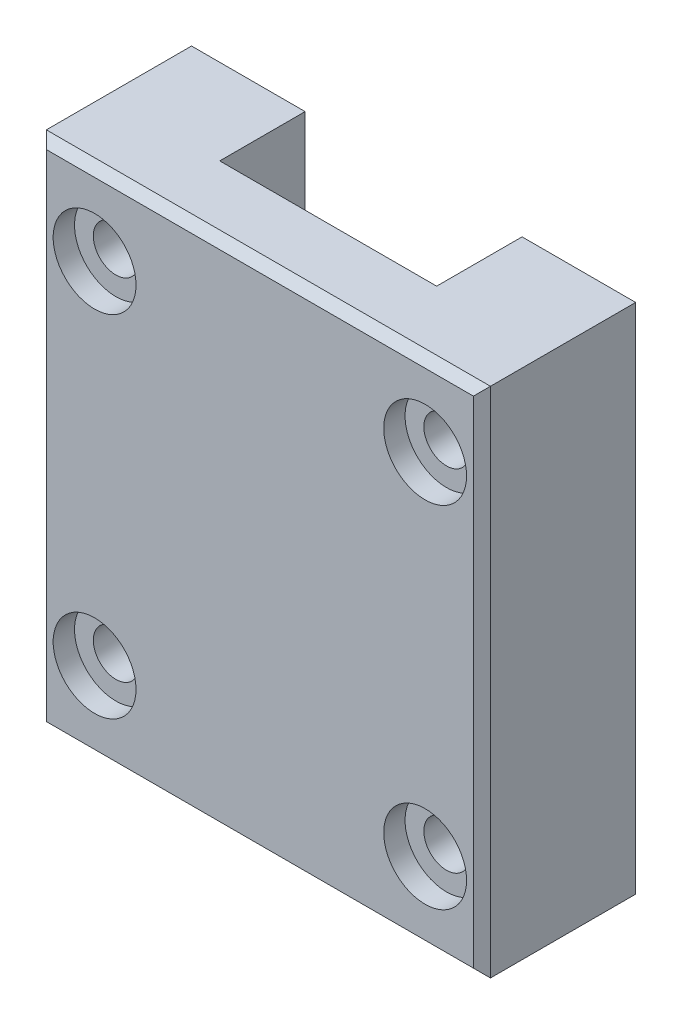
from build123d import *

# Parameters (mm, degrees)
EXTRUDE_1_DEPTH     = 8
SKETCH_2_W          = 13.3
SKETCH_2_H          = 60
EXTRUDE_2_DEPTH     = 10
SKETCH_3_R          = 2.65
CUT_EXTRUDE_1_DEPTH = 161.879116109
CHAMFER_1_SIZE      = 1
SKETCH_4_R          = 4.85
CUT_EXTRUDE_2_DEPTH = 2.5


with BuildPart() as part:
    # Sketch 1 → Extrude 1 (new body)
    with BuildSketch(Plane.XY):
        Polygon((-42, 90), (-55.3, 90), (-55.3, 150), (-42, 150), (-16.6, 150), (-3.3, 150), (-3.3, 90), (-16.6, 90), align=None)
    extrude(amount=EXTRUDE_1_DEPTH)

    # Sketch 2 → Extrude 2 (add)
    with BuildSketch(Plane(origin=(0, 0, 0), x_dir=(-1, 0, 0), z_dir=(0, 0, -1))):
        with Locations((48.65, 120)):
            Rectangle(SKETCH_2_W, SKETCH_2_H)
        with Locations((9.95, 120)):
            Rectangle(SKETCH_2_W, SKETCH_2_H)
    extrude(amount=EXTRUDE_2_DEPTH)

    # Sketch 3 → Cut-Extrude 1 (cut, through all)
    with BuildSketch(Plane.XY.offset(8)):
        with Locations((-48.65, 99.5)):
            Circle(SKETCH_3_R)
        with Locations((-9.95, 99.5)):
            Circle(SKETCH_3_R)
        with Locations((-9.95, 140.5)):
            Circle(SKETCH_3_R)
        with Locations((-48.65, 140.5)):
            Circle(SKETCH_3_R)
    extrude(amount=-CUT_EXTRUDE_1_DEPTH, mode=Mode.SUBTRACT)

    # Chamfer 1
    chamfer_1_edges = [part.edges().sort_by_distance(p)[0] for p in [
        (-29.3, 90, 8),
        (-3.3, 120, 8),
        (-29.3, 150, 8),
        (-55.3, 120, 8),
    ]]
    chamfer(chamfer_1_edges, length=CHAMFER_1_SIZE)

    # Sketch 4 → Cut-Extrude 2 (cut)
    with BuildSketch(Plane.XY.offset(8)):
        with Locations((-48.65, 140.5)):
            Circle(SKETCH_4_R)
        with Locations((-48.65, 99.5)):
            Circle(SKETCH_4_R)
        with Locations((-9.95, 99.5)):
            Circle(SKETCH_4_R)
        with Locations((-9.95, 140.5)):
            Circle(SKETCH_4_R)
    extrude(amount=-CUT_EXTRUDE_2_DEPTH, mode=Mode.SUBTRACT)


solid = part.part
